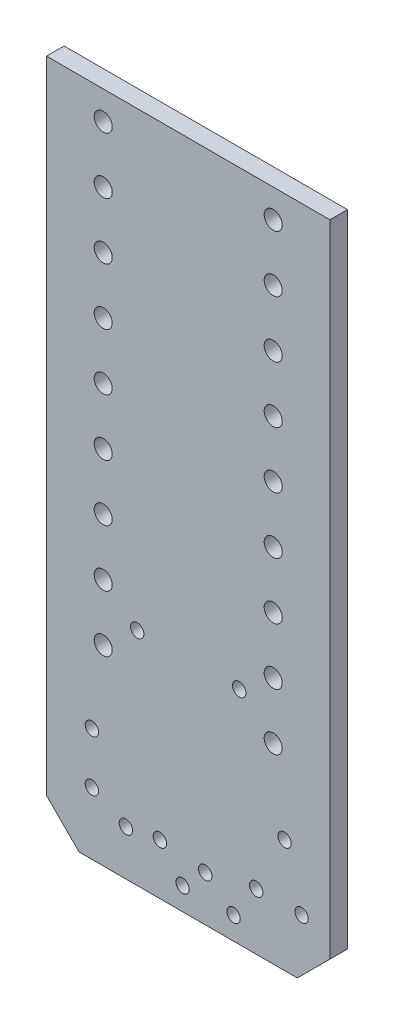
ISO-10303-21;
HEADER;
FILE_DESCRIPTION(('STEP AP214'),'2;1');
FILE_NAME('part.step','',(''),(''),'','','');
FILE_SCHEMA(('AUTOMOTIVE_DESIGN { 1 0 10303 214 1 1 1 1 }'));
ENDSEC;
DATA;
#1=APPLICATION_CONTEXT('core data for automotive mechanical design processes');
#2=APPLICATION_PROTOCOL_DEFINITION('international standard','automotive_design',2000,#1);
#3=PRODUCT_CONTEXT('',#1,'mechanical');
#4=PRODUCT('Part','Part','',(#3));
#5=PRODUCT_RELATED_PRODUCT_CATEGORY('part','',(#4));
#6=PRODUCT_DEFINITION_FORMATION('','',#4);
#7=PRODUCT_DEFINITION_CONTEXT('part definition',#1,'design');
#8=PRODUCT_DEFINITION('design','',#6,#7);
#9=PRODUCT_DEFINITION_SHAPE('','',#8);
#10=(LENGTH_UNIT() NAMED_UNIT(*) SI_UNIT(.MILLI.,.METRE.));
#11=(NAMED_UNIT(*) PLANE_ANGLE_UNIT() SI_UNIT($,.RADIAN.));
#12=(NAMED_UNIT(*) SI_UNIT($,.STERADIAN.) SOLID_ANGLE_UNIT());
#13=UNCERTAINTY_MEASURE_WITH_UNIT(LENGTH_MEASURE(1.E-05),#10,'distance_accuracy_value','');
#14=(GEOMETRIC_REPRESENTATION_CONTEXT(3) GLOBAL_UNCERTAINTY_ASSIGNED_CONTEXT((#13)) GLOBAL_UNIT_ASSIGNED_CONTEXT((#10,
#11,#12)) REPRESENTATION_CONTEXT('',''));
#15=CARTESIAN_POINT('',(0.,0.,0.));
#16=DIRECTION('',(0.,0.,1.));
#17=DIRECTION('',(1.,0.,0.));
#18=AXIS2_PLACEMENT_3D('',#15,#16,#17);
#19=CARTESIAN_POINT('',(1.4605,0.,0.7874));
#20=DIRECTION('',(0.707106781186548,0.707106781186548,0.));
#21=DIRECTION('',(-0.707106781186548,0.707106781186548,0.));
#22=AXIS2_PLACEMENT_3D('',#19,#20,#21);
#23=PLANE('',#22);
#24=DIRECTION('',(0.707106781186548,-0.707106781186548,0.));
#25=VECTOR('',#24,1.);
#26=CARTESIAN_POINT('',(1.4605,0.,0.));
#27=LINE('',#26,#25);
#28=CARTESIAN_POINT('',(0.,1.4605,0.));
#29=VERTEX_POINT('',#28);
#30=CARTESIAN_POINT('',(1.4605,0.,0.));
#31=VERTEX_POINT('',#30);
#32=EDGE_CURVE('E127',#29,#31,#27,.T.);
#33=ORIENTED_EDGE('',*,*,#32,.T.);
#34=DIRECTION('',(0.,0.,-1.));
#35=VECTOR('',#34,1.);
#36=CARTESIAN_POINT('',(1.4605,0.,0.7874));
#37=LINE('',#36,#35);
#38=CARTESIAN_POINT('',(1.4605,0.,0.7874));
#39=VERTEX_POINT('',#38);
#40=EDGE_CURVE('E11',#39,#31,#37,.T.);
#41=ORIENTED_EDGE('',*,*,#40,.F.);
#42=DIRECTION('',(0.707106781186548,-0.707106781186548,0.));
#43=VECTOR('',#42,1.);
#44=CARTESIAN_POINT('',(1.4605,0.,0.7874));
#45=LINE('',#44,#43);
#46=CARTESIAN_POINT('',(0.,1.4605,0.7874));
#47=VERTEX_POINT('',#46);
#48=EDGE_CURVE('E138',#47,#39,#45,.T.);
#49=ORIENTED_EDGE('',*,*,#48,.F.);
#50=DIRECTION('',(0.,0.,-1.));
#51=VECTOR('',#50,1.);
#52=CARTESIAN_POINT('',(0.,1.4605,0.7874));
#53=LINE('',#52,#51);
#54=EDGE_CURVE('E123',#47,#29,#53,.T.);
#55=ORIENTED_EDGE('',*,*,#54,.T.);
#56=EDGE_LOOP('',(#33,#41,#49,#55));
#57=FACE_BOUND('',#56,.T.);
#58=ADVANCED_FACE('F43',(#57),#23,.F.);
#59=CARTESIAN_POINT('',(11.2395,0.,0.7874));
#60=DIRECTION('',(0.,1.,0.));
#61=DIRECTION('',(0.,0.,1.));
#62=AXIS2_PLACEMENT_3D('',#59,#60,#61);
#63=PLANE('',#62);
#64=DIRECTION('',(1.,0.,0.));
#65=VECTOR('',#64,1.);
#66=CARTESIAN_POINT('',(11.2395,0.,0.));
#67=LINE('',#66,#65);
#68=CARTESIAN_POINT('',(11.2395,0.,0.));
#69=VERTEX_POINT('',#68);
#70=EDGE_CURVE('E130',#31,#69,#67,.T.);
#71=ORIENTED_EDGE('',*,*,#70,.T.);
#72=DIRECTION('',(0.,0.,-1.));
#73=VECTOR('',#72,1.);
#74=CARTESIAN_POINT('',(11.2395,0.,0.7874));
#75=LINE('',#74,#73);
#76=CARTESIAN_POINT('',(11.2395,0.,0.7874));
#77=VERTEX_POINT('',#76);
#78=EDGE_CURVE('E51',#77,#69,#75,.T.);
#79=ORIENTED_EDGE('',*,*,#78,.F.);
#80=DIRECTION('',(1.,0.,0.));
#81=VECTOR('',#80,1.);
#82=CARTESIAN_POINT('',(11.2395,0.,0.7874));
#83=LINE('',#82,#81);
#84=EDGE_CURVE('E96',#39,#77,#83,.T.);
#85=ORIENTED_EDGE('',*,*,#84,.F.);
#86=ORIENTED_EDGE('',*,*,#40,.T.);
#87=EDGE_LOOP('',(#71,#79,#85,#86));
#88=FACE_BOUND('',#87,.T.);
#89=ADVANCED_FACE('F163',(#88),#63,.F.);
#90=CARTESIAN_POINT('',(12.7,1.4605,0.7874));
#91=DIRECTION('',(-0.707106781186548,0.707106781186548,0.));
#92=DIRECTION('',(-0.707106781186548,-0.707106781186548,0.));
#93=AXIS2_PLACEMENT_3D('',#90,#91,#92);
#94=PLANE('',#93);
#95=DIRECTION('',(0.707106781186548,0.707106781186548,0.));
#96=VECTOR('',#95,1.);
#97=CARTESIAN_POINT('',(12.7,1.4605,0.));
#98=LINE('',#97,#96);
#99=CARTESIAN_POINT('',(12.7,1.4605,0.));
#100=VERTEX_POINT('',#99);
#101=EDGE_CURVE('E133',#69,#100,#98,.T.);
#102=ORIENTED_EDGE('',*,*,#101,.T.);
#103=DIRECTION('',(0.,0.,-1.));
#104=VECTOR('',#103,1.);
#105=CARTESIAN_POINT('',(12.7,1.4605,0.7874));
#106=LINE('',#105,#104);
#107=CARTESIAN_POINT('',(12.7,1.4605,0.7874));
#108=VERTEX_POINT('',#107);
#109=EDGE_CURVE('E118',#108,#100,#106,.T.);
#110=ORIENTED_EDGE('',*,*,#109,.F.);
#111=DIRECTION('',(0.707106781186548,0.707106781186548,0.));
#112=VECTOR('',#111,1.);
#113=CARTESIAN_POINT('',(12.7,1.4605,0.7874));
#114=LINE('',#113,#112);
#115=EDGE_CURVE('E109',#77,#108,#114,.T.);
#116=ORIENTED_EDGE('',*,*,#115,.F.);
#117=ORIENTED_EDGE('',*,*,#78,.T.);
#118=EDGE_LOOP('',(#102,#110,#116,#117));
#119=FACE_BOUND('',#118,.T.);
#120=ADVANCED_FACE('F144',(#119),#94,.F.);
#121=CARTESIAN_POINT('',(12.7,30.1625,0.7874));
#122=DIRECTION('',(-1.,0.,0.));
#123=DIRECTION('',(0.,0.,1.));
#124=AXIS2_PLACEMENT_3D('',#121,#122,#123);
#125=PLANE('',#124);
#126=DIRECTION('',(0.,1.,0.));
#127=VECTOR('',#126,1.);
#128=CARTESIAN_POINT('',(12.7,30.1625,0.));
#129=LINE('',#128,#127);
#130=CARTESIAN_POINT('',(12.7,30.1625,0.));
#131=VERTEX_POINT('',#130);
#132=EDGE_CURVE('E117',#100,#131,#129,.T.);
#133=ORIENTED_EDGE('',*,*,#132,.T.);
#134=DIRECTION('',(0.,0.,-1.));
#135=VECTOR('',#134,1.);
#136=CARTESIAN_POINT('',(12.7,30.1625,0.7874));
#137=LINE('',#136,#135);
#138=CARTESIAN_POINT('',(12.7,30.1625,0.7874));
#139=VERTEX_POINT('',#138);
#140=EDGE_CURVE('E114',#139,#131,#137,.T.);
#141=ORIENTED_EDGE('',*,*,#140,.F.);
#142=DIRECTION('',(0.,1.,0.));
#143=VECTOR('',#142,1.);
#144=CARTESIAN_POINT('',(12.7,30.1625,0.7874));
#145=LINE('',#144,#143);
#146=EDGE_CURVE('E103',#108,#139,#145,.T.);
#147=ORIENTED_EDGE('',*,*,#146,.F.);
#148=ORIENTED_EDGE('',*,*,#109,.T.);
#149=EDGE_LOOP('',(#133,#141,#147,#148));
#150=FACE_BOUND('',#149,.T.);
#151=ADVANCED_FACE('F115',(#150),#125,.F.);
#152=CARTESIAN_POINT('',(0.,30.1625,0.7874));
#153=DIRECTION('',(0.,-1.,0.));
#154=DIRECTION('',(0.,0.,-1.));
#155=AXIS2_PLACEMENT_3D('',#152,#153,#154);
#156=PLANE('',#155);
#157=DIRECTION('',(-1.,0.,0.));
#158=VECTOR('',#157,1.);
#159=CARTESIAN_POINT('',(0.,30.1625,0.));
#160=LINE('',#159,#158);
#161=CARTESIAN_POINT('',(0.,30.1625,0.));
#162=VERTEX_POINT('',#161);
#163=EDGE_CURVE('E82',#131,#162,#160,.T.);
#164=ORIENTED_EDGE('',*,*,#163,.T.);
#165=DIRECTION('',(0.,0.,-1.));
#166=VECTOR('',#165,1.);
#167=CARTESIAN_POINT('',(0.,30.1625,0.7874));
#168=LINE('',#167,#166);
#169=CARTESIAN_POINT('',(0.,30.1625,0.7874));
#170=VERTEX_POINT('',#169);
#171=EDGE_CURVE('E119',#170,#162,#168,.T.);
#172=ORIENTED_EDGE('',*,*,#171,.F.);
#173=DIRECTION('',(-1.,0.,0.));
#174=VECTOR('',#173,1.);
#175=CARTESIAN_POINT('',(0.,30.1625,0.7874));
#176=LINE('',#175,#174);
#177=EDGE_CURVE('E107',#139,#170,#176,.T.);
#178=ORIENTED_EDGE('',*,*,#177,.F.);
#179=ORIENTED_EDGE('',*,*,#140,.T.);
#180=EDGE_LOOP('',(#164,#172,#178,#179));
#181=FACE_BOUND('',#180,.T.);
#182=ADVANCED_FACE('F121',(#181),#156,.F.);
#183=CARTESIAN_POINT('',(0.,1.4605,0.7874));
#184=DIRECTION('',(1.,0.,0.));
#185=DIRECTION('',(0.,0.,-1.));
#186=AXIS2_PLACEMENT_3D('',#183,#184,#185);
#187=PLANE('',#186);
#188=DIRECTION('',(0.,-1.,0.));
#189=VECTOR('',#188,1.);
#190=CARTESIAN_POINT('',(0.,1.4605,0.));
#191=LINE('',#190,#189);
#192=EDGE_CURVE('E88',#162,#29,#191,.T.);
#193=ORIENTED_EDGE('',*,*,#192,.T.);
#194=ORIENTED_EDGE('',*,*,#54,.F.);
#195=DIRECTION('',(0.,-1.,0.));
#196=VECTOR('',#195,1.);
#197=CARTESIAN_POINT('',(0.,1.4605,0.7874));
#198=LINE('',#197,#196);
#199=EDGE_CURVE('E59',#170,#47,#198,.T.);
#200=ORIENTED_EDGE('',*,*,#199,.F.);
#201=ORIENTED_EDGE('',*,*,#171,.T.);
#202=EDGE_LOOP('',(#193,#194,#200,#201));
#203=FACE_BOUND('',#202,.T.);
#204=ADVANCED_FACE('F151',(#203),#187,.F.);
#205=CARTESIAN_POINT('',(0.,0.,0.7874));
#206=DIRECTION('',(0.,0.,1.));
#207=DIRECTION('',(1.,0.,0.));
#208=AXIS2_PLACEMENT_3D('',#205,#206,#207);
#209=PLANE('',#208);
#210=CARTESIAN_POINT('',(10.16,26.35,0.7874));
#211=DIRECTION('',(0.,0.,1.));
#212=DIRECTION('',(1.,0.,0.));
#213=AXIS2_PLACEMENT_3D('',#210,#211,#212);
#214=CIRCLE('',#213,0.405000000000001);
#215=CARTESIAN_POINT('',(10.565,26.35,0.7874));
#216=VERTEX_POINT('',#215);
#217=EDGE_CURVE('E572',#216,#216,#214,.T.);
#218=ORIENTED_EDGE('',*,*,#217,.F.);
#219=EDGE_LOOP('',(#218));
#220=FACE_BOUND('',#219,.T.);
#221=CARTESIAN_POINT('',(10.16,23.81,0.7874));
#222=DIRECTION('',(0.,0.,1.));
#223=DIRECTION('',(1.,0.,0.));
#224=AXIS2_PLACEMENT_3D('',#221,#222,#223);
#225=CIRCLE('',#224,0.405000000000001);
#226=CARTESIAN_POINT('',(10.565,23.81,0.7874));
#227=VERTEX_POINT('',#226);
#228=EDGE_CURVE('E832',#227,#227,#225,.T.);
#229=ORIENTED_EDGE('',*,*,#228,.F.);
#230=EDGE_LOOP('',(#229));
#231=FACE_BOUND('',#230,.T.);
#232=CARTESIAN_POINT('',(10.16,21.27,0.7874));
#233=DIRECTION('',(0.,0.,1.));
#234=DIRECTION('',(1.,0.,0.));
#235=AXIS2_PLACEMENT_3D('',#232,#233,#234);
#236=CIRCLE('',#235,0.405000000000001);
#237=CARTESIAN_POINT('',(10.565,21.27,0.7874));
#238=VERTEX_POINT('',#237);
#239=EDGE_CURVE('E826',#238,#238,#236,.T.);
#240=ORIENTED_EDGE('',*,*,#239,.F.);
#241=EDGE_LOOP('',(#240));
#242=FACE_BOUND('',#241,.T.);
#243=CARTESIAN_POINT('',(10.16,18.73,0.7874));
#244=DIRECTION('',(0.,0.,1.));
#245=DIRECTION('',(1.,0.,0.));
#246=AXIS2_PLACEMENT_3D('',#243,#244,#245);
#247=CIRCLE('',#246,0.405000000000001);
#248=CARTESIAN_POINT('',(10.565,18.73,0.7874));
#249=VERTEX_POINT('',#248);
#250=EDGE_CURVE('E820',#249,#249,#247,.T.);
#251=ORIENTED_EDGE('',*,*,#250,.F.);
#252=EDGE_LOOP('',(#251));
#253=FACE_BOUND('',#252,.T.);
#254=CARTESIAN_POINT('',(10.16,16.19,0.7874));
#255=DIRECTION('',(0.,0.,1.));
#256=DIRECTION('',(1.,0.,0.));
#257=AXIS2_PLACEMENT_3D('',#254,#255,#256);
#258=CIRCLE('',#257,0.405000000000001);
#259=CARTESIAN_POINT('',(10.565,16.19,0.7874));
#260=VERTEX_POINT('',#259);
#261=EDGE_CURVE('E814',#260,#260,#258,.T.);
#262=ORIENTED_EDGE('',*,*,#261,.F.);
#263=EDGE_LOOP('',(#262));
#264=FACE_BOUND('',#263,.T.);
#265=CARTESIAN_POINT('',(10.16,13.65,0.7874));
#266=DIRECTION('',(0.,0.,1.));
#267=DIRECTION('',(1.,0.,0.));
#268=AXIS2_PLACEMENT_3D('',#265,#266,#267);
#269=CIRCLE('',#268,0.405000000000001);
#270=CARTESIAN_POINT('',(10.565,13.65,0.7874));
#271=VERTEX_POINT('',#270);
#272=EDGE_CURVE('E808',#271,#271,#269,.T.);
#273=ORIENTED_EDGE('',*,*,#272,.F.);
#274=EDGE_LOOP('',(#273));
#275=FACE_BOUND('',#274,.T.);
#276=CARTESIAN_POINT('',(10.16,11.11,0.7874));
#277=DIRECTION('',(0.,0.,1.));
#278=DIRECTION('',(1.,0.,0.));
#279=AXIS2_PLACEMENT_3D('',#276,#277,#278);
#280=CIRCLE('',#279,0.405000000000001);
#281=CARTESIAN_POINT('',(10.565,11.11,0.7874));
#282=VERTEX_POINT('',#281);
#283=EDGE_CURVE('E802',#282,#282,#280,.T.);
#284=ORIENTED_EDGE('',*,*,#283,.F.);
#285=EDGE_LOOP('',(#284));
#286=FACE_BOUND('',#285,.T.);
#287=CARTESIAN_POINT('',(2.54,11.11,0.7874));
#288=DIRECTION('',(0.,0.,1.));
#289=DIRECTION('',(1.,0.,0.));
#290=AXIS2_PLACEMENT_3D('',#287,#288,#289);
#291=CIRCLE('',#290,0.405);
#292=CARTESIAN_POINT('',(2.945,11.11,0.7874));
#293=VERTEX_POINT('',#292);
#294=EDGE_CURVE('E610',#293,#293,#291,.T.);
#295=ORIENTED_EDGE('',*,*,#294,.F.);
#296=EDGE_LOOP('',(#295));
#297=FACE_BOUND('',#296,.T.);
#298=CARTESIAN_POINT('',(2.54,23.81,0.7874));
#299=DIRECTION('',(0.,0.,1.));
#300=DIRECTION('',(1.,0.,0.));
#301=AXIS2_PLACEMENT_3D('',#298,#299,#300);
#302=CIRCLE('',#301,0.405);
#303=CARTESIAN_POINT('',(2.945,23.81,0.7874));
#304=VERTEX_POINT('',#303);
#305=EDGE_CURVE('E618',#304,#304,#302,.T.);
#306=ORIENTED_EDGE('',*,*,#305,.F.);
#307=EDGE_LOOP('',(#306));
#308=FACE_BOUND('',#307,.T.);
#309=CARTESIAN_POINT('',(2.54,26.35,0.7874));
#310=DIRECTION('',(0.,0.,1.));
#311=DIRECTION('',(1.,0.,0.));
#312=AXIS2_PLACEMENT_3D('',#309,#310,#311);
#313=CIRCLE('',#312,0.405);
#314=CARTESIAN_POINT('',(2.945,26.35,0.7874));
#315=VERTEX_POINT('',#314);
#316=EDGE_CURVE('E611',#315,#315,#313,.T.);
#317=ORIENTED_EDGE('',*,*,#316,.F.);
#318=EDGE_LOOP('',(#317));
#319=FACE_BOUND('',#318,.T.);
#320=CARTESIAN_POINT('',(2.54,28.89,0.7874));
#321=DIRECTION('',(0.,0.,1.));
#322=DIRECTION('',(1.,0.,0.));
#323=AXIS2_PLACEMENT_3D('',#320,#321,#322);
#324=CIRCLE('',#323,0.405);
#325=CARTESIAN_POINT('',(2.945,28.89,0.7874));
#326=VERTEX_POINT('',#325);
#327=EDGE_CURVE('E630',#326,#326,#324,.T.);
#328=ORIENTED_EDGE('',*,*,#327,.F.);
#329=EDGE_LOOP('',(#328));
#330=FACE_BOUND('',#329,.T.);
#331=CARTESIAN_POINT('',(10.16,8.57,0.7874));
#332=DIRECTION('',(0.,0.,1.));
#333=DIRECTION('',(1.,0.,0.));
#334=AXIS2_PLACEMENT_3D('',#331,#332,#333);
#335=CIRCLE('',#334,0.405000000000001);
#336=CARTESIAN_POINT('',(10.565,8.57,0.7874));
#337=VERTEX_POINT('',#336);
#338=EDGE_CURVE('E623',#337,#337,#335,.T.);
#339=ORIENTED_EDGE('',*,*,#338,.F.);
#340=EDGE_LOOP('',(#339));
#341=FACE_BOUND('',#340,.T.);
#342=CARTESIAN_POINT('',(2.54,21.27,0.7874));
#343=DIRECTION('',(0.,0.,1.));
#344=DIRECTION('',(1.,0.,0.));
#345=AXIS2_PLACEMENT_3D('',#342,#343,#344);
#346=CIRCLE('',#345,0.405);
#347=CARTESIAN_POINT('',(2.945,21.27,0.7874));
#348=VERTEX_POINT('',#347);
#349=EDGE_CURVE('E585',#348,#348,#346,.T.);
#350=ORIENTED_EDGE('',*,*,#349,.F.);
#351=EDGE_LOOP('',(#350));
#352=FACE_BOUND('',#351,.T.);
#353=CARTESIAN_POINT('',(2.54,18.73,0.7874));
#354=DIRECTION('',(0.,0.,1.));
#355=DIRECTION('',(1.,0.,0.));
#356=AXIS2_PLACEMENT_3D('',#353,#354,#355);
#357=CIRCLE('',#356,0.405);
#358=CARTESIAN_POINT('',(2.945,18.73,0.7874));
#359=VERTEX_POINT('',#358);
#360=EDGE_CURVE('E592',#359,#359,#357,.T.);
#361=ORIENTED_EDGE('',*,*,#360,.F.);
#362=EDGE_LOOP('',(#361));
#363=FACE_BOUND('',#362,.T.);
#364=CARTESIAN_POINT('',(2.54,16.19,0.7874));
#365=DIRECTION('',(0.,0.,1.));
#366=DIRECTION('',(1.,0.,0.));
#367=AXIS2_PLACEMENT_3D('',#364,#365,#366);
#368=CIRCLE('',#367,0.405);
#369=CARTESIAN_POINT('',(2.945,16.19,0.7874));
#370=VERTEX_POINT('',#369);
#371=EDGE_CURVE('E598',#370,#370,#368,.T.);
#372=ORIENTED_EDGE('',*,*,#371,.F.);
#373=EDGE_LOOP('',(#372));
#374=FACE_BOUND('',#373,.T.);
#375=CARTESIAN_POINT('',(2.54,13.65,0.7874));
#376=DIRECTION('',(0.,0.,1.));
#377=DIRECTION('',(1.,0.,0.));
#378=AXIS2_PLACEMENT_3D('',#375,#376,#377);
#379=CIRCLE('',#378,0.405);
#380=CARTESIAN_POINT('',(2.945,13.65,0.7874));
#381=VERTEX_POINT('',#380);
#382=EDGE_CURVE('E604',#381,#381,#379,.T.);
#383=ORIENTED_EDGE('',*,*,#382,.F.);
#384=EDGE_LOOP('',(#383));
#385=FACE_BOUND('',#384,.T.);
#386=CARTESIAN_POINT('',(10.16,28.89,0.7874));
#387=DIRECTION('',(0.,0.,1.));
#388=DIRECTION('',(1.,0.,0.));
#389=AXIS2_PLACEMENT_3D('',#386,#387,#388);
#390=CIRCLE('',#389,0.405000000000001);
#391=CARTESIAN_POINT('',(10.565,28.89,0.7874));
#392=VERTEX_POINT('',#391);
#393=EDGE_CURVE('E576',#392,#392,#390,.T.);
#394=ORIENTED_EDGE('',*,*,#393,.F.);
#395=EDGE_LOOP('',(#394));
#396=FACE_BOUND('',#395,.T.);
#397=CARTESIAN_POINT('',(2.54,8.57,0.7874));
#398=DIRECTION('',(0.,0.,1.));
#399=DIRECTION('',(1.,0.,0.));
#400=AXIS2_PLACEMENT_3D('',#397,#398,#399);
#401=CIRCLE('',#400,0.405);
#402=CARTESIAN_POINT('',(2.945,8.57,0.7874));
#403=VERTEX_POINT('',#402);
#404=EDGE_CURVE('E635',#403,#403,#401,.T.);
#405=ORIENTED_EDGE('',*,*,#404,.F.);
#406=EDGE_LOOP('',(#405));
#407=FACE_BOUND('',#406,.T.);
#408=CARTESIAN_POINT('',(9.398,2.54,0.7874));
#409=DIRECTION('',(0.,0.,1.));
#410=DIRECTION('',(1.,0.,0.));
#411=AXIS2_PLACEMENT_3D('',#408,#409,#410);
#412=CIRCLE('',#411,0.3);
#413=CARTESIAN_POINT('',(9.698,2.54,0.7874));
#414=VERTEX_POINT('',#413);
#415=EDGE_CURVE('E678',#414,#414,#412,.T.);
#416=ORIENTED_EDGE('',*,*,#415,.F.);
#417=EDGE_LOOP('',(#416));
#418=FACE_BOUND('',#417,.T.);
#419=CARTESIAN_POINT('',(11.43,2.54,0.7874));
#420=DIRECTION('',(0.,0.,1.));
#421=DIRECTION('',(1.,0.,0.));
#422=AXIS2_PLACEMENT_3D('',#419,#420,#421);
#423=CIRCLE('',#422,0.3);
#424=CARTESIAN_POINT('',(11.73,2.54,0.7874));
#425=VERTEX_POINT('',#424);
#426=EDGE_CURVE('E672',#425,#425,#423,.T.);
#427=ORIENTED_EDGE('',*,*,#426,.F.);
#428=EDGE_LOOP('',(#427));
#429=FACE_BOUND('',#428,.T.);
#430=CARTESIAN_POINT('',(8.636,9.906,0.7874));
#431=DIRECTION('',(0.,0.,1.));
#432=DIRECTION('',(1.,0.,0.));
#433=AXIS2_PLACEMENT_3D('',#430,#431,#432);
#434=CIRCLE('',#433,0.3);
#435=CARTESIAN_POINT('',(8.936,9.906,0.7874));
#436=VERTEX_POINT('',#435);
#437=EDGE_CURVE('E666',#436,#436,#434,.T.);
#438=ORIENTED_EDGE('',*,*,#437,.F.);
#439=EDGE_LOOP('',(#438));
#440=FACE_BOUND('',#439,.T.);
#441=CARTESIAN_POINT('',(4.064,9.906,0.7874));
#442=DIRECTION('',(0.,0.,1.));
#443=DIRECTION('',(1.,0.,0.));
#444=AXIS2_PLACEMENT_3D('',#441,#442,#443);
#445=CIRCLE('',#444,0.3);
#446=CARTESIAN_POINT('',(4.364,9.906,0.7874));
#447=VERTEX_POINT('',#446);
#448=EDGE_CURVE('E659',#447,#447,#445,.T.);
#449=ORIENTED_EDGE('',*,*,#448,.F.);
#450=EDGE_LOOP('',(#449));
#451=FACE_BOUND('',#450,.T.);
#452=CARTESIAN_POINT('',(2.032,2.794,0.7874));
#453=DIRECTION('',(0.,0.,1.));
#454=DIRECTION('',(1.,0.,0.));
#455=AXIS2_PLACEMENT_3D('',#452,#453,#454);
#456=CIRCLE('',#455,0.3);
#457=CARTESIAN_POINT('',(2.332,2.794,0.7874));
#458=VERTEX_POINT('',#457);
#459=EDGE_CURVE('E703',#458,#458,#456,.T.);
#460=ORIENTED_EDGE('',*,*,#459,.F.);
#461=EDGE_LOOP('',(#460));
#462=FACE_BOUND('',#461,.T.);
#463=CARTESIAN_POINT('',(3.556,2.032,0.7874));
#464=DIRECTION('',(0.,0.,1.));
#465=DIRECTION('',(1.,0.,0.));
#466=AXIS2_PLACEMENT_3D('',#463,#464,#465);
#467=CIRCLE('',#466,0.3);
#468=CARTESIAN_POINT('',(3.856,2.032,0.7874));
#469=VERTEX_POINT('',#468);
#470=EDGE_CURVE('E697',#469,#469,#467,.T.);
#471=ORIENTED_EDGE('',*,*,#470,.F.);
#472=EDGE_LOOP('',(#471));
#473=FACE_BOUND('',#472,.T.);
#474=CARTESIAN_POINT('',(5.08,2.286,0.7874));
#475=DIRECTION('',(0.,0.,1.));
#476=DIRECTION('',(1.,0.,0.));
#477=AXIS2_PLACEMENT_3D('',#474,#475,#476);
#478=CIRCLE('',#477,0.3);
#479=CARTESIAN_POINT('',(5.38,2.286,0.7874));
#480=VERTEX_POINT('',#479);
#481=EDGE_CURVE('E691',#480,#480,#478,.T.);
#482=ORIENTED_EDGE('',*,*,#481,.F.);
#483=EDGE_LOOP('',(#482));
#484=FACE_BOUND('',#483,.T.);
#485=CARTESIAN_POINT('',(6.096,1.016,0.7874));
#486=DIRECTION('',(0.,0.,1.));
#487=DIRECTION('',(1.,0.,0.));
#488=AXIS2_PLACEMENT_3D('',#485,#486,#487);
#489=CIRCLE('',#488,0.3);
#490=CARTESIAN_POINT('',(6.396,1.016,0.7874));
#491=VERTEX_POINT('',#490);
#492=EDGE_CURVE('E683',#491,#491,#489,.T.);
#493=ORIENTED_EDGE('',*,*,#492,.F.);
#494=EDGE_LOOP('',(#493));
#495=FACE_BOUND('',#494,.T.);
#496=CARTESIAN_POINT('',(8.382,1.016,0.7874));
#497=DIRECTION('',(0.,0.,1.));
#498=DIRECTION('',(1.,0.,0.));
#499=AXIS2_PLACEMENT_3D('',#496,#497,#498);
#500=CIRCLE('',#499,0.3);
#501=CARTESIAN_POINT('',(8.682,1.016,0.7874));
#502=VERTEX_POINT('',#501);
#503=EDGE_CURVE('E641',#502,#502,#500,.T.);
#504=ORIENTED_EDGE('',*,*,#503,.F.);
#505=EDGE_LOOP('',(#504));
#506=FACE_BOUND('',#505,.T.);
#507=CARTESIAN_POINT('',(7.112,2.032,0.7874));
#508=DIRECTION('',(0.,0.,1.));
#509=DIRECTION('',(1.,0.,0.));
#510=AXIS2_PLACEMENT_3D('',#507,#508,#509);
#511=CIRCLE('',#510,0.3);
#512=CARTESIAN_POINT('',(7.412,2.032,0.7874));
#513=VERTEX_POINT('',#512);
#514=EDGE_CURVE('E648',#513,#513,#511,.T.);
#515=ORIENTED_EDGE('',*,*,#514,.F.);
#516=EDGE_LOOP('',(#515));
#517=FACE_BOUND('',#516,.T.);
#518=CARTESIAN_POINT('',(10.668,5.08,0.7874));
#519=DIRECTION('',(0.,0.,1.));
#520=DIRECTION('',(1.,0.,0.));
#521=AXIS2_PLACEMENT_3D('',#518,#519,#520);
#522=CIRCLE('',#521,0.3);
#523=CARTESIAN_POINT('',(10.968,5.08,0.7874));
#524=VERTEX_POINT('',#523);
#525=EDGE_CURVE('E654',#524,#524,#522,.T.);
#526=ORIENTED_EDGE('',*,*,#525,.F.);
#527=EDGE_LOOP('',(#526));
#528=FACE_BOUND('',#527,.T.);
#529=CARTESIAN_POINT('',(2.032,5.08,0.7874));
#530=DIRECTION('',(0.,0.,1.));
#531=DIRECTION('',(1.,0.,0.));
#532=AXIS2_PLACEMENT_3D('',#529,#530,#531);
#533=CIRCLE('',#532,0.3);
#534=CARTESIAN_POINT('',(2.332,5.08,0.7874));
#535=VERTEX_POINT('',#534);
#536=EDGE_CURVE('E131',#535,#535,#533,.T.);
#537=ORIENTED_EDGE('',*,*,#536,.F.);
#538=EDGE_LOOP('',(#537));
#539=FACE_BOUND('',#538,.T.);
#540=ORIENTED_EDGE('',*,*,#48,.T.);
#541=ORIENTED_EDGE('',*,*,#84,.T.);
#542=ORIENTED_EDGE('',*,*,#115,.T.);
#543=ORIENTED_EDGE('',*,*,#146,.T.);
#544=ORIENTED_EDGE('',*,*,#177,.T.);
#545=ORIENTED_EDGE('',*,*,#199,.T.);
#546=EDGE_LOOP('',(#540,#541,#542,#543,#544,#545));
#547=FACE_BOUND('',#546,.T.);
#548=ADVANCED_FACE('F105',(#220,#231,#242,#253,#264,#275,#286,#297,#308,#319,#330,#341,#352,
#363,#374,#385,#396,#407,#418,#429,#440,#451,#462,#473,#484,#495,#506,#517,#528,#539,#547),#209,.T.);
#549=CARTESIAN_POINT('',(0.,0.,0.));
#550=DIRECTION('',(0.,0.,1.));
#551=DIRECTION('',(1.,0.,0.));
#552=AXIS2_PLACEMENT_3D('',#549,#550,#551);
#553=PLANE('',#552);
#554=CARTESIAN_POINT('',(10.16,26.35,0.));
#555=DIRECTION('',(0.,0.,1.));
#556=DIRECTION('',(1.,0.,0.));
#557=AXIS2_PLACEMENT_3D('',#554,#555,#556);
#558=CIRCLE('',#557,0.405000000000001);
#559=CARTESIAN_POINT('',(10.565,26.35,0.));
#560=VERTEX_POINT('',#559);
#561=EDGE_CURVE('E575',#560,#560,#558,.T.);
#562=ORIENTED_EDGE('',*,*,#561,.T.);
#563=EDGE_LOOP('',(#562));
#564=FACE_BOUND('',#563,.T.);
#565=CARTESIAN_POINT('',(10.16,23.81,0.));
#566=DIRECTION('',(0.,0.,1.));
#567=DIRECTION('',(1.,0.,0.));
#568=AXIS2_PLACEMENT_3D('',#565,#566,#567);
#569=CIRCLE('',#568,0.405000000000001);
#570=CARTESIAN_POINT('',(10.565,23.81,0.));
#571=VERTEX_POINT('',#570);
#572=EDGE_CURVE('E578',#571,#571,#569,.T.);
#573=ORIENTED_EDGE('',*,*,#572,.T.);
#574=EDGE_LOOP('',(#573));
#575=FACE_BOUND('',#574,.T.);
#576=CARTESIAN_POINT('',(10.16,21.27,0.));
#577=DIRECTION('',(0.,0.,1.));
#578=DIRECTION('',(1.,0.,0.));
#579=AXIS2_PLACEMENT_3D('',#576,#577,#578);
#580=CIRCLE('',#579,0.405000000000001);
#581=CARTESIAN_POINT('',(10.565,21.27,0.));
#582=VERTEX_POINT('',#581);
#583=EDGE_CURVE('E829',#582,#582,#580,.T.);
#584=ORIENTED_EDGE('',*,*,#583,.T.);
#585=EDGE_LOOP('',(#584));
#586=FACE_BOUND('',#585,.T.);
#587=CARTESIAN_POINT('',(10.16,18.73,0.));
#588=DIRECTION('',(0.,0.,1.));
#589=DIRECTION('',(1.,0.,0.));
#590=AXIS2_PLACEMENT_3D('',#587,#588,#589);
#591=CIRCLE('',#590,0.405000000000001);
#592=CARTESIAN_POINT('',(10.565,18.73,0.));
#593=VERTEX_POINT('',#592);
#594=EDGE_CURVE('E823',#593,#593,#591,.T.);
#595=ORIENTED_EDGE('',*,*,#594,.T.);
#596=EDGE_LOOP('',(#595));
#597=FACE_BOUND('',#596,.T.);
#598=CARTESIAN_POINT('',(10.16,16.19,0.));
#599=DIRECTION('',(0.,0.,1.));
#600=DIRECTION('',(1.,0.,0.));
#601=AXIS2_PLACEMENT_3D('',#598,#599,#600);
#602=CIRCLE('',#601,0.405000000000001);
#603=CARTESIAN_POINT('',(10.565,16.19,0.));
#604=VERTEX_POINT('',#603);
#605=EDGE_CURVE('E817',#604,#604,#602,.T.);
#606=ORIENTED_EDGE('',*,*,#605,.T.);
#607=EDGE_LOOP('',(#606));
#608=FACE_BOUND('',#607,.T.);
#609=CARTESIAN_POINT('',(10.16,13.65,0.));
#610=DIRECTION('',(0.,0.,1.));
#611=DIRECTION('',(1.,0.,0.));
#612=AXIS2_PLACEMENT_3D('',#609,#610,#611);
#613=CIRCLE('',#612,0.405000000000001);
#614=CARTESIAN_POINT('',(10.565,13.65,0.));
#615=VERTEX_POINT('',#614);
#616=EDGE_CURVE('E811',#615,#615,#613,.T.);
#617=ORIENTED_EDGE('',*,*,#616,.T.);
#618=EDGE_LOOP('',(#617));
#619=FACE_BOUND('',#618,.T.);
#620=CARTESIAN_POINT('',(10.16,11.11,0.));
#621=DIRECTION('',(0.,0.,1.));
#622=DIRECTION('',(1.,0.,0.));
#623=AXIS2_PLACEMENT_3D('',#620,#621,#622);
#624=CIRCLE('',#623,0.405000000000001);
#625=CARTESIAN_POINT('',(10.565,11.11,0.));
#626=VERTEX_POINT('',#625);
#627=EDGE_CURVE('E805',#626,#626,#624,.T.);
#628=ORIENTED_EDGE('',*,*,#627,.T.);
#629=EDGE_LOOP('',(#628));
#630=FACE_BOUND('',#629,.T.);
#631=CARTESIAN_POINT('',(2.54,11.11,0.));
#632=DIRECTION('',(0.,0.,1.));
#633=DIRECTION('',(1.,0.,0.));
#634=AXIS2_PLACEMENT_3D('',#631,#632,#633);
#635=CIRCLE('',#634,0.405);
#636=CARTESIAN_POINT('',(2.945,11.11,0.));
#637=VERTEX_POINT('',#636);
#638=EDGE_CURVE('E799',#637,#637,#635,.T.);
#639=ORIENTED_EDGE('',*,*,#638,.T.);
#640=EDGE_LOOP('',(#639));
#641=FACE_BOUND('',#640,.T.);
#642=CARTESIAN_POINT('',(2.54,23.81,0.));
#643=DIRECTION('',(0.,0.,1.));
#644=DIRECTION('',(1.,0.,0.));
#645=AXIS2_PLACEMENT_3D('',#642,#643,#644);
#646=CIRCLE('',#645,0.405);
#647=CARTESIAN_POINT('',(2.945,23.81,0.));
#648=VERTEX_POINT('',#647);
#649=EDGE_CURVE('E588',#648,#648,#646,.T.);
#650=ORIENTED_EDGE('',*,*,#649,.T.);
#651=EDGE_LOOP('',(#650));
#652=FACE_BOUND('',#651,.T.);
#653=CARTESIAN_POINT('',(2.54,26.35,0.));
#654=DIRECTION('',(0.,0.,1.));
#655=DIRECTION('',(1.,0.,0.));
#656=AXIS2_PLACEMENT_3D('',#653,#654,#655);
#657=CIRCLE('',#656,0.405);
#658=CARTESIAN_POINT('',(2.945,26.35,0.));
#659=VERTEX_POINT('',#658);
#660=EDGE_CURVE('E615',#659,#659,#657,.T.);
#661=ORIENTED_EDGE('',*,*,#660,.T.);
#662=EDGE_LOOP('',(#661));
#663=FACE_BOUND('',#662,.T.);
#664=CARTESIAN_POINT('',(2.54,28.89,0.));
#665=DIRECTION('',(0.,0.,1.));
#666=DIRECTION('',(1.,0.,0.));
#667=AXIS2_PLACEMENT_3D('',#664,#665,#666);
#668=CIRCLE('',#667,0.405);
#669=CARTESIAN_POINT('',(2.945,28.89,0.));
#670=VERTEX_POINT('',#669);
#671=EDGE_CURVE('E614',#670,#670,#668,.T.);
#672=ORIENTED_EDGE('',*,*,#671,.T.);
#673=EDGE_LOOP('',(#672));
#674=FACE_BOUND('',#673,.T.);
#675=CARTESIAN_POINT('',(10.16,8.57,0.));
#676=DIRECTION('',(0.,0.,1.));
#677=DIRECTION('',(1.,0.,0.));
#678=AXIS2_PLACEMENT_3D('',#675,#676,#677);
#679=CIRCLE('',#678,0.405000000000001);
#680=CARTESIAN_POINT('',(10.565,8.57,0.));
#681=VERTEX_POINT('',#680);
#682=EDGE_CURVE('E627',#681,#681,#679,.T.);
#683=ORIENTED_EDGE('',*,*,#682,.T.);
#684=EDGE_LOOP('',(#683));
#685=FACE_BOUND('',#684,.T.);
#686=CARTESIAN_POINT('',(2.54,21.27,0.));
#687=DIRECTION('',(0.,0.,1.));
#688=DIRECTION('',(1.,0.,0.));
#689=AXIS2_PLACEMENT_3D('',#686,#687,#688);
#690=CIRCLE('',#689,0.405);
#691=CARTESIAN_POINT('',(2.945,21.27,0.));
#692=VERTEX_POINT('',#691);
#693=EDGE_CURVE('E589',#692,#692,#690,.T.);
#694=ORIENTED_EDGE('',*,*,#693,.T.);
#695=EDGE_LOOP('',(#694));
#696=FACE_BOUND('',#695,.T.);
#697=CARTESIAN_POINT('',(2.54,18.73,0.));
#698=DIRECTION('',(0.,0.,1.));
#699=DIRECTION('',(1.,0.,0.));
#700=AXIS2_PLACEMENT_3D('',#697,#698,#699);
#701=CIRCLE('',#700,0.405);
#702=CARTESIAN_POINT('',(2.945,18.73,0.));
#703=VERTEX_POINT('',#702);
#704=EDGE_CURVE('E595',#703,#703,#701,.T.);
#705=ORIENTED_EDGE('',*,*,#704,.T.);
#706=EDGE_LOOP('',(#705));
#707=FACE_BOUND('',#706,.T.);
#708=CARTESIAN_POINT('',(2.54,16.19,0.));
#709=DIRECTION('',(0.,0.,1.));
#710=DIRECTION('',(1.,0.,0.));
#711=AXIS2_PLACEMENT_3D('',#708,#709,#710);
#712=CIRCLE('',#711,0.405);
#713=CARTESIAN_POINT('',(2.945,16.19,0.));
#714=VERTEX_POINT('',#713);
#715=EDGE_CURVE('E601',#714,#714,#712,.T.);
#716=ORIENTED_EDGE('',*,*,#715,.T.);
#717=EDGE_LOOP('',(#716));
#718=FACE_BOUND('',#717,.T.);
#719=CARTESIAN_POINT('',(2.54,13.65,0.));
#720=DIRECTION('',(0.,0.,1.));
#721=DIRECTION('',(1.,0.,0.));
#722=AXIS2_PLACEMENT_3D('',#719,#720,#721);
#723=CIRCLE('',#722,0.405);
#724=CARTESIAN_POINT('',(2.945,13.65,0.));
#725=VERTEX_POINT('',#724);
#726=EDGE_CURVE('E607',#725,#725,#723,.T.);
#727=ORIENTED_EDGE('',*,*,#726,.T.);
#728=EDGE_LOOP('',(#727));
#729=FACE_BOUND('',#728,.T.);
#730=CARTESIAN_POINT('',(10.16,28.89,0.));
#731=DIRECTION('',(0.,0.,1.));
#732=DIRECTION('',(1.,0.,0.));
#733=AXIS2_PLACEMENT_3D('',#730,#731,#732);
#734=CIRCLE('',#733,0.405000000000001);
#735=CARTESIAN_POINT('',(10.565,28.89,0.));
#736=VERTEX_POINT('',#735);
#737=EDGE_CURVE('E581',#736,#736,#734,.T.);
#738=ORIENTED_EDGE('',*,*,#737,.T.);
#739=EDGE_LOOP('',(#738));
#740=FACE_BOUND('',#739,.T.);
#741=CARTESIAN_POINT('',(2.54,8.57,0.));
#742=DIRECTION('',(0.,0.,1.));
#743=DIRECTION('',(1.,0.,0.));
#744=AXIS2_PLACEMENT_3D('',#741,#742,#743);
#745=CIRCLE('',#744,0.405);
#746=CARTESIAN_POINT('',(2.945,8.57,0.));
#747=VERTEX_POINT('',#746);
#748=EDGE_CURVE('E626',#747,#747,#745,.T.);
#749=ORIENTED_EDGE('',*,*,#748,.T.);
#750=EDGE_LOOP('',(#749));
#751=FACE_BOUND('',#750,.T.);
#752=CARTESIAN_POINT('',(9.398,2.54,0.));
#753=DIRECTION('',(0.,0.,1.));
#754=DIRECTION('',(1.,0.,0.));
#755=AXIS2_PLACEMENT_3D('',#752,#753,#754);
#756=CIRCLE('',#755,0.3);
#757=CARTESIAN_POINT('',(9.698,2.54,0.));
#758=VERTEX_POINT('',#757);
#759=EDGE_CURVE('E644',#758,#758,#756,.T.);
#760=ORIENTED_EDGE('',*,*,#759,.T.);
#761=EDGE_LOOP('',(#760));
#762=FACE_BOUND('',#761,.T.);
#763=CARTESIAN_POINT('',(11.43,2.54,0.));
#764=DIRECTION('',(0.,0.,1.));
#765=DIRECTION('',(1.,0.,0.));
#766=AXIS2_PLACEMENT_3D('',#763,#764,#765);
#767=CIRCLE('',#766,0.3);
#768=CARTESIAN_POINT('',(11.73,2.54,0.));
#769=VERTEX_POINT('',#768);
#770=EDGE_CURVE('E675',#769,#769,#767,.T.);
#771=ORIENTED_EDGE('',*,*,#770,.T.);
#772=EDGE_LOOP('',(#771));
#773=FACE_BOUND('',#772,.T.);
#774=CARTESIAN_POINT('',(8.636,9.906,0.));
#775=DIRECTION('',(0.,0.,1.));
#776=DIRECTION('',(1.,0.,0.));
#777=AXIS2_PLACEMENT_3D('',#774,#775,#776);
#778=CIRCLE('',#777,0.3);
#779=CARTESIAN_POINT('',(8.936,9.906,0.));
#780=VERTEX_POINT('',#779);
#781=EDGE_CURVE('E669',#780,#780,#778,.T.);
#782=ORIENTED_EDGE('',*,*,#781,.T.);
#783=EDGE_LOOP('',(#782));
#784=FACE_BOUND('',#783,.T.);
#785=CARTESIAN_POINT('',(4.064,9.906,0.));
#786=DIRECTION('',(0.,0.,1.));
#787=DIRECTION('',(1.,0.,0.));
#788=AXIS2_PLACEMENT_3D('',#785,#786,#787);
#789=CIRCLE('',#788,0.3);
#790=CARTESIAN_POINT('',(4.364,9.906,0.));
#791=VERTEX_POINT('',#790);
#792=EDGE_CURVE('E663',#791,#791,#789,.T.);
#793=ORIENTED_EDGE('',*,*,#792,.T.);
#794=EDGE_LOOP('',(#793));
#795=FACE_BOUND('',#794,.T.);
#796=CARTESIAN_POINT('',(2.032,2.794,0.));
#797=DIRECTION('',(0.,0.,1.));
#798=DIRECTION('',(1.,0.,0.));
#799=AXIS2_PLACEMENT_3D('',#796,#797,#798);
#800=CIRCLE('',#799,0.3);
#801=CARTESIAN_POINT('',(2.332,2.794,0.));
#802=VERTEX_POINT('',#801);
#803=EDGE_CURVE('E662',#802,#802,#800,.T.);
#804=ORIENTED_EDGE('',*,*,#803,.T.);
#805=EDGE_LOOP('',(#804));
#806=FACE_BOUND('',#805,.T.);
#807=CARTESIAN_POINT('',(3.556,2.032,0.));
#808=DIRECTION('',(0.,0.,1.));
#809=DIRECTION('',(1.,0.,0.));
#810=AXIS2_PLACEMENT_3D('',#807,#808,#809);
#811=CIRCLE('',#810,0.3);
#812=CARTESIAN_POINT('',(3.856,2.032,0.));
#813=VERTEX_POINT('',#812);
#814=EDGE_CURVE('E700',#813,#813,#811,.T.);
#815=ORIENTED_EDGE('',*,*,#814,.T.);
#816=EDGE_LOOP('',(#815));
#817=FACE_BOUND('',#816,.T.);
#818=CARTESIAN_POINT('',(5.08,2.286,0.));
#819=DIRECTION('',(0.,0.,1.));
#820=DIRECTION('',(1.,0.,0.));
#821=AXIS2_PLACEMENT_3D('',#818,#819,#820);
#822=CIRCLE('',#821,0.3);
#823=CARTESIAN_POINT('',(5.38,2.286,0.));
#824=VERTEX_POINT('',#823);
#825=EDGE_CURVE('E694',#824,#824,#822,.T.);
#826=ORIENTED_EDGE('',*,*,#825,.T.);
#827=EDGE_LOOP('',(#826));
#828=FACE_BOUND('',#827,.T.);
#829=CARTESIAN_POINT('',(6.096,1.016,0.));
#830=DIRECTION('',(0.,0.,1.));
#831=DIRECTION('',(1.,0.,0.));
#832=AXIS2_PLACEMENT_3D('',#829,#830,#831);
#833=CIRCLE('',#832,0.3);
#834=CARTESIAN_POINT('',(6.396,1.016,0.));
#835=VERTEX_POINT('',#834);
#836=EDGE_CURVE('E687',#835,#835,#833,.T.);
#837=ORIENTED_EDGE('',*,*,#836,.T.);
#838=EDGE_LOOP('',(#837));
#839=FACE_BOUND('',#838,.T.);
#840=CARTESIAN_POINT('',(8.382,1.016,0.));
#841=DIRECTION('',(0.,0.,1.));
#842=DIRECTION('',(1.,0.,0.));
#843=AXIS2_PLACEMENT_3D('',#840,#841,#842);
#844=CIRCLE('',#843,0.3);
#845=CARTESIAN_POINT('',(8.682,1.016,0.));
#846=VERTEX_POINT('',#845);
#847=EDGE_CURVE('E645',#846,#846,#844,.T.);
#848=ORIENTED_EDGE('',*,*,#847,.T.);
#849=EDGE_LOOP('',(#848));
#850=FACE_BOUND('',#849,.T.);
#851=CARTESIAN_POINT('',(7.112,2.032,0.));
#852=DIRECTION('',(0.,0.,1.));
#853=DIRECTION('',(1.,0.,0.));
#854=AXIS2_PLACEMENT_3D('',#851,#852,#853);
#855=CIRCLE('',#854,0.3);
#856=CARTESIAN_POINT('',(7.412,2.032,0.));
#857=VERTEX_POINT('',#856);
#858=EDGE_CURVE('E651',#857,#857,#855,.T.);
#859=ORIENTED_EDGE('',*,*,#858,.T.);
#860=EDGE_LOOP('',(#859));
#861=FACE_BOUND('',#860,.T.);
#862=CARTESIAN_POINT('',(10.668,5.08,0.));
#863=DIRECTION('',(0.,0.,1.));
#864=DIRECTION('',(1.,0.,0.));
#865=AXIS2_PLACEMENT_3D('',#862,#863,#864);
#866=CIRCLE('',#865,0.3);
#867=CARTESIAN_POINT('',(10.968,5.08,0.));
#868=VERTEX_POINT('',#867);
#869=EDGE_CURVE('E638',#868,#868,#866,.T.);
#870=ORIENTED_EDGE('',*,*,#869,.T.);
#871=EDGE_LOOP('',(#870));
#872=FACE_BOUND('',#871,.T.);
#873=CARTESIAN_POINT('',(2.032,5.08,0.));
#874=DIRECTION('',(0.,0.,1.));
#875=DIRECTION('',(1.,0.,0.));
#876=AXIS2_PLACEMENT_3D('',#873,#874,#875);
#877=CIRCLE('',#876,0.3);
#878=CARTESIAN_POINT('',(2.332,5.08,0.));
#879=VERTEX_POINT('',#878);
#880=EDGE_CURVE('E686',#879,#879,#877,.T.);
#881=ORIENTED_EDGE('',*,*,#880,.T.);
#882=EDGE_LOOP('',(#881));
#883=FACE_BOUND('',#882,.T.);
#884=ORIENTED_EDGE('',*,*,#32,.F.);
#885=ORIENTED_EDGE('',*,*,#192,.F.);
#886=ORIENTED_EDGE('',*,*,#163,.F.);
#887=ORIENTED_EDGE('',*,*,#132,.F.);
#888=ORIENTED_EDGE('',*,*,#101,.F.);
#889=ORIENTED_EDGE('',*,*,#70,.F.);
#890=EDGE_LOOP('',(#884,#885,#886,#887,#888,#889));
#891=FACE_BOUND('',#890,.T.);
#892=ADVANCED_FACE('F147',(#564,#575,#586,#597,#608,#619,#630,#641,#652,#663,#674,#685,#696,
#707,#718,#729,#740,#751,#762,#773,#784,#795,#806,#817,#828,#839,#850,#861,#872,#883,#891),#553,.F.);
#893=CARTESIAN_POINT('',(2.032,5.08,0.7874));
#894=DIRECTION('',(0.,0.,-1.));
#895=DIRECTION('',(-1.,0.,0.));
#896=AXIS2_PLACEMENT_3D('',#893,#894,#895);
#897=CYLINDRICAL_SURFACE('',#896,0.3);
#898=ORIENTED_EDGE('',*,*,#536,.T.);
#899=EDGE_LOOP('',(#898));
#900=FACE_BOUND('',#899,.T.);
#901=ORIENTED_EDGE('',*,*,#880,.F.);
#902=EDGE_LOOP('',(#901));
#903=FACE_BOUND('',#902,.T.);
#904=ADVANCED_FACE('F202',(#900,#903),#897,.F.);
#905=CARTESIAN_POINT('',(10.668,5.08,0.7874));
#906=DIRECTION('',(0.,0.,-1.));
#907=DIRECTION('',(-1.,0.,0.));
#908=AXIS2_PLACEMENT_3D('',#905,#906,#907);
#909=CYLINDRICAL_SURFACE('',#908,0.3);
#910=ORIENTED_EDGE('',*,*,#525,.T.);
#911=EDGE_LOOP('',(#910));
#912=FACE_BOUND('',#911,.T.);
#913=ORIENTED_EDGE('',*,*,#869,.F.);
#914=EDGE_LOOP('',(#913));
#915=FACE_BOUND('',#914,.T.);
#916=ADVANCED_FACE('F209',(#912,#915),#909,.F.);
#917=CARTESIAN_POINT('',(7.112,2.032,0.7874));
#918=DIRECTION('',(0.,0.,-1.));
#919=DIRECTION('',(-1.,0.,0.));
#920=AXIS2_PLACEMENT_3D('',#917,#918,#919);
#921=CYLINDRICAL_SURFACE('',#920,0.3);
#922=ORIENTED_EDGE('',*,*,#514,.T.);
#923=EDGE_LOOP('',(#922));
#924=FACE_BOUND('',#923,.T.);
#925=ORIENTED_EDGE('',*,*,#858,.F.);
#926=EDGE_LOOP('',(#925));
#927=FACE_BOUND('',#926,.T.);
#928=ADVANCED_FACE('F218',(#924,#927),#921,.F.);
#929=CARTESIAN_POINT('',(8.382,1.016,0.7874));
#930=DIRECTION('',(0.,0.,-1.));
#931=DIRECTION('',(-1.,0.,0.));
#932=AXIS2_PLACEMENT_3D('',#929,#930,#931);
#933=CYLINDRICAL_SURFACE('',#932,0.3);
#934=ORIENTED_EDGE('',*,*,#503,.T.);
#935=EDGE_LOOP('',(#934));
#936=FACE_BOUND('',#935,.T.);
#937=ORIENTED_EDGE('',*,*,#847,.F.);
#938=EDGE_LOOP('',(#937));
#939=FACE_BOUND('',#938,.T.);
#940=ADVANCED_FACE('F227',(#936,#939),#933,.F.);
#941=CARTESIAN_POINT('',(6.096,1.016,0.7874));
#942=DIRECTION('',(0.,0.,-1.));
#943=DIRECTION('',(-1.,0.,0.));
#944=AXIS2_PLACEMENT_3D('',#941,#942,#943);
#945=CYLINDRICAL_SURFACE('',#944,0.3);
#946=ORIENTED_EDGE('',*,*,#492,.T.);
#947=EDGE_LOOP('',(#946));
#948=FACE_BOUND('',#947,.T.);
#949=ORIENTED_EDGE('',*,*,#836,.F.);
#950=EDGE_LOOP('',(#949));
#951=FACE_BOUND('',#950,.T.);
#952=ADVANCED_FACE('F236',(#948,#951),#945,.F.);
#953=CARTESIAN_POINT('',(5.08,2.286,0.7874));
#954=DIRECTION('',(0.,0.,-1.));
#955=DIRECTION('',(-1.,0.,0.));
#956=AXIS2_PLACEMENT_3D('',#953,#954,#955);
#957=CYLINDRICAL_SURFACE('',#956,0.3);
#958=ORIENTED_EDGE('',*,*,#481,.T.);
#959=EDGE_LOOP('',(#958));
#960=FACE_BOUND('',#959,.T.);
#961=ORIENTED_EDGE('',*,*,#825,.F.);
#962=EDGE_LOOP('',(#961));
#963=FACE_BOUND('',#962,.T.);
#964=ADVANCED_FACE('F245',(#960,#963),#957,.F.);
#965=CARTESIAN_POINT('',(3.556,2.032,0.7874));
#966=DIRECTION('',(0.,0.,-1.));
#967=DIRECTION('',(-1.,0.,0.));
#968=AXIS2_PLACEMENT_3D('',#965,#966,#967);
#969=CYLINDRICAL_SURFACE('',#968,0.3);
#970=ORIENTED_EDGE('',*,*,#470,.T.);
#971=EDGE_LOOP('',(#970));
#972=FACE_BOUND('',#971,.T.);
#973=ORIENTED_EDGE('',*,*,#814,.F.);
#974=EDGE_LOOP('',(#973));
#975=FACE_BOUND('',#974,.T.);
#976=ADVANCED_FACE('F254',(#972,#975),#969,.F.);
#977=CARTESIAN_POINT('',(2.032,2.794,0.7874));
#978=DIRECTION('',(0.,0.,-1.));
#979=DIRECTION('',(-1.,0.,0.));
#980=AXIS2_PLACEMENT_3D('',#977,#978,#979);
#981=CYLINDRICAL_SURFACE('',#980,0.3);
#982=ORIENTED_EDGE('',*,*,#459,.T.);
#983=EDGE_LOOP('',(#982));
#984=FACE_BOUND('',#983,.T.);
#985=ORIENTED_EDGE('',*,*,#803,.F.);
#986=EDGE_LOOP('',(#985));
#987=FACE_BOUND('',#986,.T.);
#988=ADVANCED_FACE('F261',(#984,#987),#981,.F.);
#989=CARTESIAN_POINT('',(4.064,9.906,0.7874));
#990=DIRECTION('',(0.,0.,-1.));
#991=DIRECTION('',(-1.,0.,0.));
#992=AXIS2_PLACEMENT_3D('',#989,#990,#991);
#993=CYLINDRICAL_SURFACE('',#992,0.3);
#994=ORIENTED_EDGE('',*,*,#448,.T.);
#995=EDGE_LOOP('',(#994));
#996=FACE_BOUND('',#995,.T.);
#997=ORIENTED_EDGE('',*,*,#792,.F.);
#998=EDGE_LOOP('',(#997));
#999=FACE_BOUND('',#998,.T.);
#1000=ADVANCED_FACE('F268',(#996,#999),#993,.F.);
#1001=CARTESIAN_POINT('',(8.636,9.906,0.7874));
#1002=DIRECTION('',(0.,0.,-1.));
#1003=DIRECTION('',(-1.,0.,0.));
#1004=AXIS2_PLACEMENT_3D('',#1001,#1002,#1003);
#1005=CYLINDRICAL_SURFACE('',#1004,0.3);
#1006=ORIENTED_EDGE('',*,*,#437,.T.);
#1007=EDGE_LOOP('',(#1006));
#1008=FACE_BOUND('',#1007,.T.);
#1009=ORIENTED_EDGE('',*,*,#781,.F.);
#1010=EDGE_LOOP('',(#1009));
#1011=FACE_BOUND('',#1010,.T.);
#1012=ADVANCED_FACE('F275',(#1008,#1011),#1005,.F.);
#1013=CARTESIAN_POINT('',(11.43,2.54,0.7874));
#1014=DIRECTION('',(0.,0.,-1.));
#1015=DIRECTION('',(-1.,0.,0.));
#1016=AXIS2_PLACEMENT_3D('',#1013,#1014,#1015);
#1017=CYLINDRICAL_SURFACE('',#1016,0.3);
#1018=ORIENTED_EDGE('',*,*,#426,.T.);
#1019=EDGE_LOOP('',(#1018));
#1020=FACE_BOUND('',#1019,.T.);
#1021=ORIENTED_EDGE('',*,*,#770,.F.);
#1022=EDGE_LOOP('',(#1021));
#1023=FACE_BOUND('',#1022,.T.);
#1024=ADVANCED_FACE('F282',(#1020,#1023),#1017,.F.);
#1025=CARTESIAN_POINT('',(9.398,2.54,0.7874));
#1026=DIRECTION('',(0.,0.,-1.));
#1027=DIRECTION('',(-1.,0.,0.));
#1028=AXIS2_PLACEMENT_3D('',#1025,#1026,#1027);
#1029=CYLINDRICAL_SURFACE('',#1028,0.3);
#1030=ORIENTED_EDGE('',*,*,#415,.T.);
#1031=EDGE_LOOP('',(#1030));
#1032=FACE_BOUND('',#1031,.T.);
#1033=ORIENTED_EDGE('',*,*,#759,.F.);
#1034=EDGE_LOOP('',(#1033));
#1035=FACE_BOUND('',#1034,.T.);
#1036=ADVANCED_FACE('F289',(#1032,#1035),#1029,.F.);
#1037=CARTESIAN_POINT('',(2.54,8.57,0.7874));
#1038=DIRECTION('',(0.,0.,-1.));
#1039=DIRECTION('',(-1.,0.,0.));
#1040=AXIS2_PLACEMENT_3D('',#1037,#1038,#1039);
#1041=CYLINDRICAL_SURFACE('',#1040,0.405);
#1042=ORIENTED_EDGE('',*,*,#404,.T.);
#1043=EDGE_LOOP('',(#1042));
#1044=FACE_BOUND('',#1043,.T.);
#1045=ORIENTED_EDGE('',*,*,#748,.F.);
#1046=EDGE_LOOP('',(#1045));
#1047=FACE_BOUND('',#1046,.T.);
#1048=ADVANCED_FACE('F296',(#1044,#1047),#1041,.F.);
#1049=CARTESIAN_POINT('',(10.16,28.89,0.7874));
#1050=DIRECTION('',(0.,0.,-1.));
#1051=DIRECTION('',(-1.,0.,0.));
#1052=AXIS2_PLACEMENT_3D('',#1049,#1050,#1051);
#1053=CYLINDRICAL_SURFACE('',#1052,0.405000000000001);
#1054=ORIENTED_EDGE('',*,*,#393,.T.);
#1055=EDGE_LOOP('',(#1054));
#1056=FACE_BOUND('',#1055,.T.);
#1057=ORIENTED_EDGE('',*,*,#737,.F.);
#1058=EDGE_LOOP('',(#1057));
#1059=FACE_BOUND('',#1058,.T.);
#1060=ADVANCED_FACE('F304',(#1056,#1059),#1053,.F.);
#1061=CARTESIAN_POINT('',(2.54,13.65,0.7874));
#1062=DIRECTION('',(0.,0.,-1.));
#1063=DIRECTION('',(-1.,0.,0.));
#1064=AXIS2_PLACEMENT_3D('',#1061,#1062,#1063);
#1065=CYLINDRICAL_SURFACE('',#1064,0.405);
#1066=ORIENTED_EDGE('',*,*,#382,.T.);
#1067=EDGE_LOOP('',(#1066));
#1068=FACE_BOUND('',#1067,.T.);
#1069=ORIENTED_EDGE('',*,*,#726,.F.);
#1070=EDGE_LOOP('',(#1069));
#1071=FACE_BOUND('',#1070,.T.);
#1072=ADVANCED_FACE('F312',(#1068,#1071),#1065,.F.);
#1073=CARTESIAN_POINT('',(2.54,16.19,0.7874));
#1074=DIRECTION('',(0.,0.,-1.));
#1075=DIRECTION('',(-1.,0.,0.));
#1076=AXIS2_PLACEMENT_3D('',#1073,#1074,#1075);
#1077=CYLINDRICAL_SURFACE('',#1076,0.405);
#1078=ORIENTED_EDGE('',*,*,#371,.T.);
#1079=EDGE_LOOP('',(#1078));
#1080=FACE_BOUND('',#1079,.T.);
#1081=ORIENTED_EDGE('',*,*,#715,.F.);
#1082=EDGE_LOOP('',(#1081));
#1083=FACE_BOUND('',#1082,.T.);
#1084=ADVANCED_FACE('F320',(#1080,#1083),#1077,.F.);
#1085=CARTESIAN_POINT('',(2.54,18.73,0.7874));
#1086=DIRECTION('',(0.,0.,-1.));
#1087=DIRECTION('',(-1.,0.,0.));
#1088=AXIS2_PLACEMENT_3D('',#1085,#1086,#1087);
#1089=CYLINDRICAL_SURFACE('',#1088,0.405);
#1090=ORIENTED_EDGE('',*,*,#360,.T.);
#1091=EDGE_LOOP('',(#1090));
#1092=FACE_BOUND('',#1091,.T.);
#1093=ORIENTED_EDGE('',*,*,#704,.F.);
#1094=EDGE_LOOP('',(#1093));
#1095=FACE_BOUND('',#1094,.T.);
#1096=ADVANCED_FACE('F328',(#1092,#1095),#1089,.F.);
#1097=CARTESIAN_POINT('',(2.54,21.27,0.7874));
#1098=DIRECTION('',(0.,0.,-1.));
#1099=DIRECTION('',(-1.,0.,0.));
#1100=AXIS2_PLACEMENT_3D('',#1097,#1098,#1099);
#1101=CYLINDRICAL_SURFACE('',#1100,0.405);
#1102=ORIENTED_EDGE('',*,*,#349,.T.);
#1103=EDGE_LOOP('',(#1102));
#1104=FACE_BOUND('',#1103,.T.);
#1105=ORIENTED_EDGE('',*,*,#693,.F.);
#1106=EDGE_LOOP('',(#1105));
#1107=FACE_BOUND('',#1106,.T.);
#1108=ADVANCED_FACE('F336',(#1104,#1107),#1101,.F.);
#1109=CARTESIAN_POINT('',(10.16,8.57,0.7874));
#1110=DIRECTION('',(0.,0.,-1.));
#1111=DIRECTION('',(-1.,0.,0.));
#1112=AXIS2_PLACEMENT_3D('',#1109,#1110,#1111);
#1113=CYLINDRICAL_SURFACE('',#1112,0.405000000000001);
#1114=ORIENTED_EDGE('',*,*,#338,.T.);
#1115=EDGE_LOOP('',(#1114));
#1116=FACE_BOUND('',#1115,.T.);
#1117=ORIENTED_EDGE('',*,*,#682,.F.);
#1118=EDGE_LOOP('',(#1117));
#1119=FACE_BOUND('',#1118,.T.);
#1120=ADVANCED_FACE('F344',(#1116,#1119),#1113,.F.);
#1121=CARTESIAN_POINT('',(2.54,28.89,0.7874));
#1122=DIRECTION('',(0.,0.,-1.));
#1123=DIRECTION('',(-1.,0.,0.));
#1124=AXIS2_PLACEMENT_3D('',#1121,#1122,#1123);
#1125=CYLINDRICAL_SURFACE('',#1124,0.405);
#1126=ORIENTED_EDGE('',*,*,#327,.T.);
#1127=EDGE_LOOP('',(#1126));
#1128=FACE_BOUND('',#1127,.T.);
#1129=ORIENTED_EDGE('',*,*,#671,.F.);
#1130=EDGE_LOOP('',(#1129));
#1131=FACE_BOUND('',#1130,.T.);
#1132=ADVANCED_FACE('F352',(#1128,#1131),#1125,.F.);
#1133=CARTESIAN_POINT('',(2.54,26.35,0.7874));
#1134=DIRECTION('',(0.,0.,-1.));
#1135=DIRECTION('',(-1.,0.,0.));
#1136=AXIS2_PLACEMENT_3D('',#1133,#1134,#1135);
#1137=CYLINDRICAL_SURFACE('',#1136,0.405);
#1138=ORIENTED_EDGE('',*,*,#316,.T.);
#1139=EDGE_LOOP('',(#1138));
#1140=FACE_BOUND('',#1139,.T.);
#1141=ORIENTED_EDGE('',*,*,#660,.F.);
#1142=EDGE_LOOP('',(#1141));
#1143=FACE_BOUND('',#1142,.T.);
#1144=ADVANCED_FACE('F360',(#1140,#1143),#1137,.F.);
#1145=CARTESIAN_POINT('',(2.54,23.81,0.7874));
#1146=DIRECTION('',(0.,0.,-1.));
#1147=DIRECTION('',(-1.,0.,0.));
#1148=AXIS2_PLACEMENT_3D('',#1145,#1146,#1147);
#1149=CYLINDRICAL_SURFACE('',#1148,0.405);
#1150=ORIENTED_EDGE('',*,*,#305,.T.);
#1151=EDGE_LOOP('',(#1150));
#1152=FACE_BOUND('',#1151,.T.);
#1153=ORIENTED_EDGE('',*,*,#649,.F.);
#1154=EDGE_LOOP('',(#1153));
#1155=FACE_BOUND('',#1154,.T.);
#1156=ADVANCED_FACE('F368',(#1152,#1155),#1149,.F.);
#1157=CARTESIAN_POINT('',(2.54,11.11,0.7874));
#1158=DIRECTION('',(0.,0.,-1.));
#1159=DIRECTION('',(-1.,0.,0.));
#1160=AXIS2_PLACEMENT_3D('',#1157,#1158,#1159);
#1161=CYLINDRICAL_SURFACE('',#1160,0.405);
#1162=ORIENTED_EDGE('',*,*,#294,.T.);
#1163=EDGE_LOOP('',(#1162));
#1164=FACE_BOUND('',#1163,.T.);
#1165=ORIENTED_EDGE('',*,*,#638,.F.);
#1166=EDGE_LOOP('',(#1165));
#1167=FACE_BOUND('',#1166,.T.);
#1168=ADVANCED_FACE('F376',(#1164,#1167),#1161,.F.);
#1169=CARTESIAN_POINT('',(10.16,11.11,0.7874));
#1170=DIRECTION('',(0.,0.,-1.));
#1171=DIRECTION('',(-1.,0.,0.));
#1172=AXIS2_PLACEMENT_3D('',#1169,#1170,#1171);
#1173=CYLINDRICAL_SURFACE('',#1172,0.405000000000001);
#1174=ORIENTED_EDGE('',*,*,#283,.T.);
#1175=EDGE_LOOP('',(#1174));
#1176=FACE_BOUND('',#1175,.T.);
#1177=ORIENTED_EDGE('',*,*,#627,.F.);
#1178=EDGE_LOOP('',(#1177));
#1179=FACE_BOUND('',#1178,.T.);
#1180=ADVANCED_FACE('F384',(#1176,#1179),#1173,.F.);
#1181=CARTESIAN_POINT('',(10.16,13.65,0.7874));
#1182=DIRECTION('',(0.,0.,-1.));
#1183=DIRECTION('',(-1.,0.,0.));
#1184=AXIS2_PLACEMENT_3D('',#1181,#1182,#1183);
#1185=CYLINDRICAL_SURFACE('',#1184,0.405000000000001);
#1186=ORIENTED_EDGE('',*,*,#272,.T.);
#1187=EDGE_LOOP('',(#1186));
#1188=FACE_BOUND('',#1187,.T.);
#1189=ORIENTED_EDGE('',*,*,#616,.F.);
#1190=EDGE_LOOP('',(#1189));
#1191=FACE_BOUND('',#1190,.T.);
#1192=ADVANCED_FACE('F392',(#1188,#1191),#1185,.F.);
#1193=CARTESIAN_POINT('',(10.16,16.19,0.7874));
#1194=DIRECTION('',(0.,0.,-1.));
#1195=DIRECTION('',(-1.,0.,0.));
#1196=AXIS2_PLACEMENT_3D('',#1193,#1194,#1195);
#1197=CYLINDRICAL_SURFACE('',#1196,0.405000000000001);
#1198=ORIENTED_EDGE('',*,*,#261,.T.);
#1199=EDGE_LOOP('',(#1198));
#1200=FACE_BOUND('',#1199,.T.);
#1201=ORIENTED_EDGE('',*,*,#605,.F.);
#1202=EDGE_LOOP('',(#1201));
#1203=FACE_BOUND('',#1202,.T.);
#1204=ADVANCED_FACE('F400',(#1200,#1203),#1197,.F.);
#1205=CARTESIAN_POINT('',(10.16,18.73,0.7874));
#1206=DIRECTION('',(0.,0.,-1.));
#1207=DIRECTION('',(-1.,0.,0.));
#1208=AXIS2_PLACEMENT_3D('',#1205,#1206,#1207);
#1209=CYLINDRICAL_SURFACE('',#1208,0.405000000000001);
#1210=ORIENTED_EDGE('',*,*,#250,.T.);
#1211=EDGE_LOOP('',(#1210));
#1212=FACE_BOUND('',#1211,.T.);
#1213=ORIENTED_EDGE('',*,*,#594,.F.);
#1214=EDGE_LOOP('',(#1213));
#1215=FACE_BOUND('',#1214,.T.);
#1216=ADVANCED_FACE('F408',(#1212,#1215),#1209,.F.);
#1217=CARTESIAN_POINT('',(10.16,21.27,0.7874));
#1218=DIRECTION('',(0.,0.,-1.));
#1219=DIRECTION('',(-1.,0.,0.));
#1220=AXIS2_PLACEMENT_3D('',#1217,#1218,#1219);
#1221=CYLINDRICAL_SURFACE('',#1220,0.405000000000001);
#1222=ORIENTED_EDGE('',*,*,#239,.T.);
#1223=EDGE_LOOP('',(#1222));
#1224=FACE_BOUND('',#1223,.T.);
#1225=ORIENTED_EDGE('',*,*,#583,.F.);
#1226=EDGE_LOOP('',(#1225));
#1227=FACE_BOUND('',#1226,.T.);
#1228=ADVANCED_FACE('F416',(#1224,#1227),#1221,.F.);
#1229=CARTESIAN_POINT('',(10.16,23.81,0.7874));
#1230=DIRECTION('',(0.,0.,-1.));
#1231=DIRECTION('',(-1.,0.,0.));
#1232=AXIS2_PLACEMENT_3D('',#1229,#1230,#1231);
#1233=CYLINDRICAL_SURFACE('',#1232,0.405000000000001);
#1234=ORIENTED_EDGE('',*,*,#228,.T.);
#1235=EDGE_LOOP('',(#1234));
#1236=FACE_BOUND('',#1235,.T.);
#1237=ORIENTED_EDGE('',*,*,#572,.F.);
#1238=EDGE_LOOP('',(#1237));
#1239=FACE_BOUND('',#1238,.T.);
#1240=ADVANCED_FACE('F424',(#1236,#1239),#1233,.F.);
#1241=CARTESIAN_POINT('',(10.16,26.35,0.7874));
#1242=DIRECTION('',(0.,0.,-1.));
#1243=DIRECTION('',(-1.,0.,0.));
#1244=AXIS2_PLACEMENT_3D('',#1241,#1242,#1243);
#1245=CYLINDRICAL_SURFACE('',#1244,0.405000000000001);
#1246=ORIENTED_EDGE('',*,*,#217,.T.);
#1247=EDGE_LOOP('',(#1246));
#1248=FACE_BOUND('',#1247,.T.);
#1249=ORIENTED_EDGE('',*,*,#561,.F.);
#1250=EDGE_LOOP('',(#1249));
#1251=FACE_BOUND('',#1250,.T.);
#1252=ADVANCED_FACE('F432',(#1248,#1251),#1245,.F.);
#1253=CLOSED_SHELL('',(#58,#89,#120,#151,#182,#204,#548,#892,#904,#916,#928,#940,#952,#964,#976,
#988,#1000,#1012,#1024,#1036,#1048,#1060,#1072,#1084,#1096,#1108,#1120,#1132,#1144,#1156,#1168,
#1180,#1192,#1204,#1216,#1228,#1240,#1252));
#1254=MANIFOLD_SOLID_BREP('B2',#1253);
#1255=ADVANCED_BREP_SHAPE_REPRESENTATION('',(#18,#1254),#14);
#1256=SHAPE_DEFINITION_REPRESENTATION(#9,#1255);
ENDSEC;
END-ISO-10303-21;
